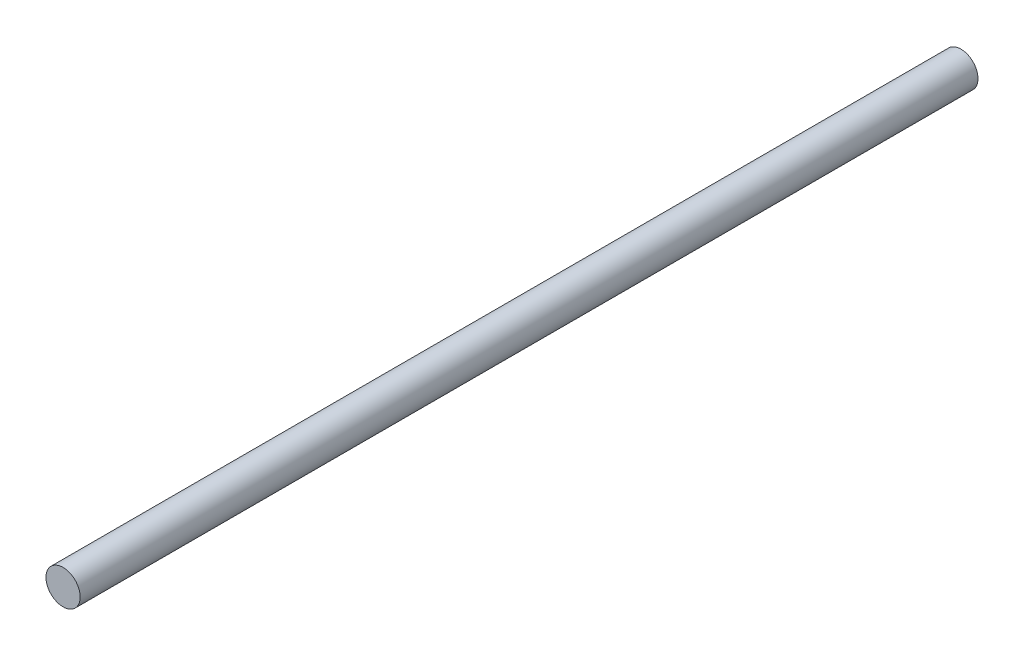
from build123d import *

# Parameters (mm, degrees)
CROQUIS1_R              = 4
SALIENTE_EXTRUIR1_DEPTH = 210


with BuildPart() as part:
    # Croquis1 → Saliente-Extruir1 (new body)
    with BuildSketch(Plane.XY):
        Circle(CROQUIS1_R)
    extrude(amount=SALIENTE_EXTRUIR1_DEPTH)


solid = part.part
